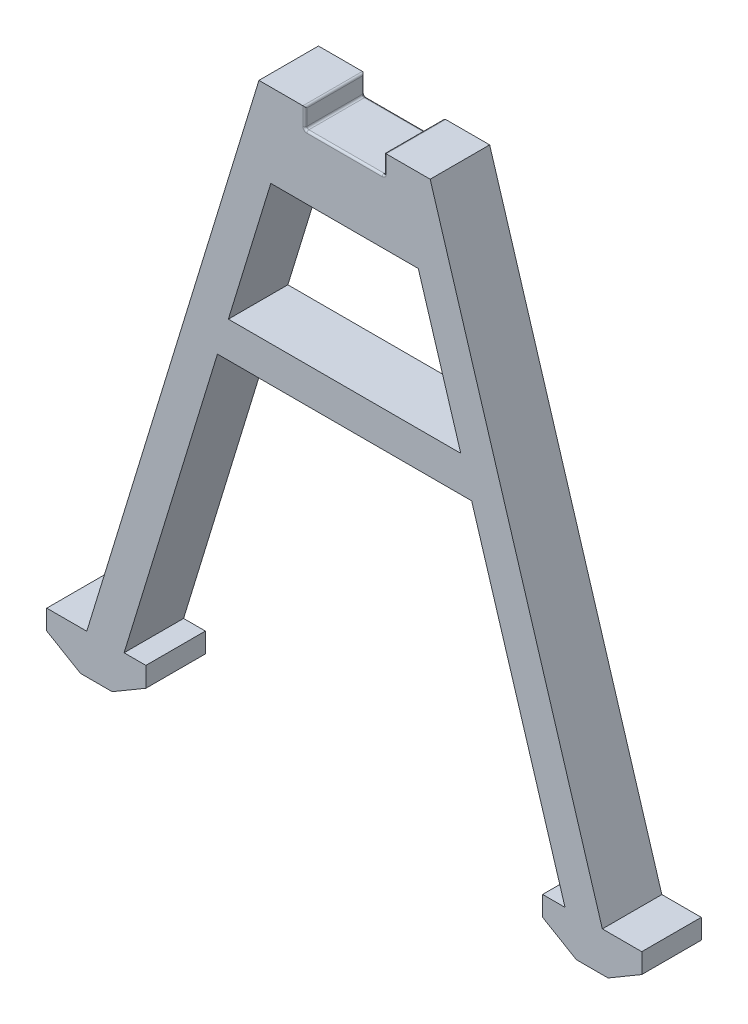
from build123d import *

# Parameters (mm, degrees)
SKETCH1_W           = 160
SKETCH1_H           = 45
BOSS_EXTRUDE1_DEPTH = 15
BOSS_EXTRUDE2_DEPTH = 7.5
SKETCH3_W           = 20
SKETCH3_H           = 10
CUT_EXTRUDE1_DEPTH  = 179.742832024
FILLET1_R           = 0.5
SKETCH4_W           = 83
SKETCH4_H           = 60
CUT_EXTRUDE2_DEPTH  = 23
SKETCH5_OUTSIDE_W   = 207.728
SKETCH5_OUTSIDE_H   = 92.728
SKETCH5_OUTSIDE_W_2 = 25
SKETCH5_OUTSIDE_H_2 = 15
CUT_EXTRUDE6_DEPTH  = 165.530392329
SKETCH6_W           = 25
SKETCH6_H           = 15
CUT_EXTRUDE7_DEPTH  = 5
CUT_EXTRUDE8_DEPTH  = 175.678899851


with BuildPart() as part:
    # Sketch1 → Boss-Extrude1 (new body)
    with BuildSketch(Plane(origin=(0, 0, 0), x_dir=(1, 0, 0), z_dir=(0, 1, 0))):
        Rectangle(SKETCH1_W, SKETCH1_H)
    extrude(amount=BOSS_EXTRUDE1_DEPTH)

    # Sketch2 → Boss-Extrude2 (add, symmetric)
    with BuildSketch(Plane.XY):
        Polygon((-65, 15), (-21.586243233, 157), (21.586243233, 157), (65, 15), align=None)
    extrude(amount=BOSS_EXTRUDE2_DEPTH, both=True)

    # Sketch3 → Cut-Extrude1 (cut, through all)
    with BuildSketch(Plane.XY.offset(7.5)):
        Polygon((-55.588774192, 15), (55.588774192, 15), (32.047511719, 92), (-32.047511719, 92), align=None)
        Polygon((-29.295935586, 101), (29.295935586, 101), (18.595361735, 136), (-18.595361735, 136), align=None)
        with Locations((0, 157)):
            Rectangle(SKETCH3_W, SKETCH3_H)
    extrude(amount=-CUT_EXTRUDE1_DEPTH, mode=Mode.SUBTRACT)

    # Fillet1
    fillet1_edges = [part.edges().sort_by_distance(p)[0] for p in [
        (-10, 154.5, -7.5),
        (0, 152, -7.5),
        (10, 154.5, -7.5),
        (10, 154.5, 7.5),
        (-10, 154.5, 7.5),
        (0, 152, 7.5),
        (10, 157, 0),
        (-10, 157, 0),
        (-10, 152, 0),
        (10, 152, 0),
    ]]
    fillet(fillet1_edges, radius=FILLET1_R)

    # Sketch4 → Cut-Extrude2 (cut)
    with BuildSketch(Plane(origin=(0, 15, 0), x_dir=(1, 0, 0), z_dir=(0, 1, 0))):
        Rectangle(SKETCH4_W, SKETCH4_H)
    extrude(amount=-CUT_EXTRUDE2_DEPTH, mode=Mode.SUBTRACT)

    # Sketch5 outside → Cut-Extrude6 (cut, through all)
    with BuildSketch(Plane(origin=(0, 15, 0), x_dir=(1, 0, 0), z_dir=(0, 1, 0))):
        Rectangle(SKETCH5_OUTSIDE_W, SKETCH5_OUTSIDE_H)
        with Locations((-62.591397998, 0)):
            Rectangle(SKETCH5_OUTSIDE_W_2, SKETCH5_OUTSIDE_H_2, mode=Mode.SUBTRACT)
        with Locations((62.438586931, 0)):
            Rectangle(SKETCH5_OUTSIDE_W_2, SKETCH5_OUTSIDE_H_2, mode=Mode.SUBTRACT)
    extrude(amount=-CUT_EXTRUDE6_DEPTH, mode=Mode.SUBTRACT)

    # Sketch6 → Cut-Extrude7 (cut)
    with BuildSketch(Plane.XZ):
        with Locations((-62.591397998, 0)):
            Rectangle(SKETCH6_W, SKETCH6_H)
        with Locations((62.438586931, 0)):
            Rectangle(SKETCH6_W, SKETCH6_H)
    extrude(amount=-CUT_EXTRUDE7_DEPTH, mode=Mode.SUBTRACT)

    # Sketch7 → Cut-Extrude8 (cut, through all)
    with BuildSketch(Plane.XY.offset(7.5)):
        Polygon((-75.091397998, 10), (-66.591397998, 5), (-75.091397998, 5), align=None)
        Polygon((-50.091397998, 10), (-50.091397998, 5), (-58.591397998, 5), align=None)
        Polygon((49.938586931, 10), (58.438586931, 5), (49.938586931, 5), align=None)
        Polygon((74.938586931, 10), (66.438586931, 5), (74.938586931, 5), align=None)
    extrude(amount=-CUT_EXTRUDE8_DEPTH, mode=Mode.SUBTRACT)


solid = part.part
